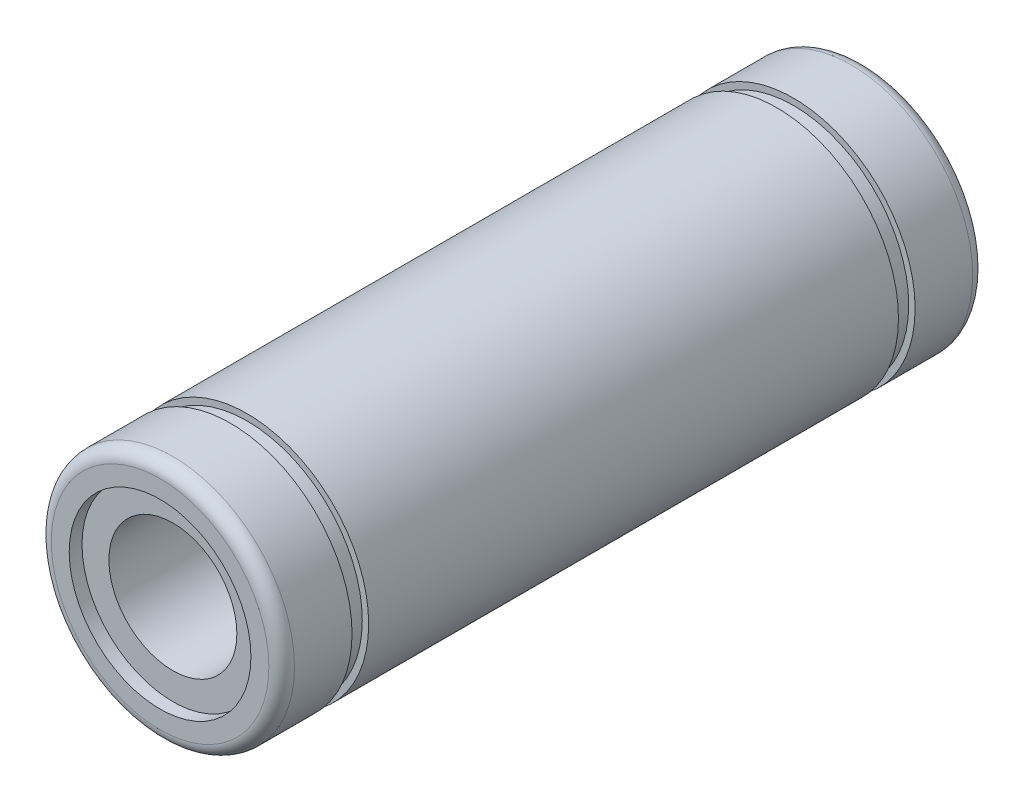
from build123d import *

# Parameters (mm, degrees)
SKETCH1_R           = 9.5
SKETCH1_R_2         = 5
BOSS_EXTRUDE1_DEPTH = 55
SKETCH2_R           = 7.1
CUT_EXTRUDE1_DEPTH  = 1
CUT_EXTRUDE2_START  = -1
SKETCH3_R           = 7.1
CUT_EXTRUDE2_DEPTH  = 1
SKETCH4_W           = 0.5
SKETCH4_H           = 1.3
FILLET1_R           = 1


with BuildPart() as part:
    # Sketch1 → Boss-Extrude1 (new body)
    with BuildSketch(Plane.XY):
        Circle(SKETCH1_R)
        Circle(SKETCH1_R_2, mode=Mode.SUBTRACT)
    extrude(amount=BOSS_EXTRUDE1_DEPTH)

    # Sketch2 → Cut-Extrude1 (cut)
    with BuildSketch(Plane.XY.offset(55)):
        Circle(SKETCH2_R)
    extrude(amount=-CUT_EXTRUDE1_DEPTH, mode=Mode.SUBTRACT)

    # Sketch3 → Cut-Extrude2 (cut)
    with BuildSketch(Plane(origin=(0, 0, 0), x_dir=(-1, 0, 0), z_dir=(0, 0, -1)).offset(CUT_EXTRUDE2_START)):
        with Locations(Location((0, 0, 0), (0, 0, 180))):
            Circle(SKETCH3_R)
    extrude(amount=CUT_EXTRUDE2_DEPTH, mode=Mode.SUBTRACT)

    # Sketch4 → Cut-Revolve1 (revolve, cut)
    with BuildSketch(Plane(origin=(0, 0, 0), x_dir=(1, 0, 0), z_dir=(0, 1, 0))):
        with Locations((-9.25, -48.85)):
            Rectangle(SKETCH4_W, SKETCH4_H)
        with Locations((-9.25, -6.15)):
            Rectangle(SKETCH4_W, SKETCH4_H)
    revolve(axis=Axis((0, 0, 0), (0, 0, 1)), mode=Mode.SUBTRACT)

    # Fillet1
    fillet1_edges = [part.edges().sort_by_distance(p)[0] for p in [
        (-9.5, 0, 0),
        (-9.5, 0, 55),
    ]]
    fillet(fillet1_edges, radius=FILLET1_R)


solid = part.part
